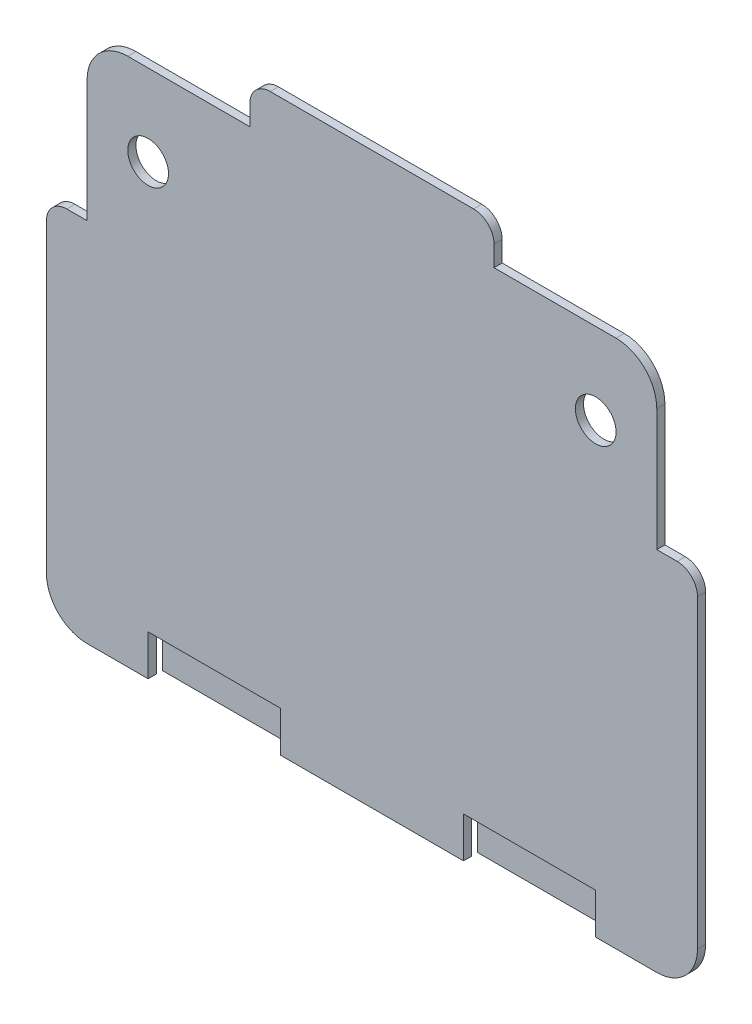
from build123d import *

# Parameters (mm, degrees)
BOSS_EXTRUDE1_DEPTH = 2
SKETCH2_W           = 32.5
SKETCH2_H           = 1.2
BOSS_EXTRUDE2_DEPTH = 1.5
SKETCH3_W           = 32.5
SKETCH3_H           = 10
SKETCH3_H_2         = 1.2
BOSS_EXTRUDE3_DEPTH = 1.2
SKETCH4_W           = 32.5
SKETCH4_H           = 10
SKETCH4_H_2         = 1.2
BOSS_EXTRUDE4_DEPTH = 1.2
SKETCH5_R           = 5
CUT_EXTRUDE1_DEPTH  = 143.21946665
FILLET3_R           = 10
FILLET4_R           = 10
FILLET5_R           = 5


with BuildPart() as part:
    # Sketch1 → Boss-Extrude1 (new body)
    with BuildSketch(Plane.XY):
        Polygon((97.407407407, -36.481481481), (97.407407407, 53.518518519), (87.407407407, 53.518518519), (87.407407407, 93.518518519), (47.407407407, 93.518518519), (47.407407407, 103.518518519), (-12.592592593, 103.518518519), (-12.592592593, 93.518518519), (-52.592592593, 93.518518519), (-52.592592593, 53.518518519), (-62.592592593, 53.518518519), (-62.592592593, -36.481481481), (-37.592592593, -36.481481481), (-37.592592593, -26.481481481), (-5.092592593, -26.481481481), (-5.092592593, -36.481481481), (39.907407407, -36.481481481), (39.907407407, -26.481481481), (72.407407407, -26.481481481), (72.407407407, -36.481481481), align=None)
    extrude(amount=BOSS_EXTRUDE1_DEPTH)

    # Sketch2 → Boss-Extrude2 (add)
    with BuildSketch(Plane(origin=(0, 0, 0), x_dir=(-1, 0, 0), z_dir=(0, 0, -1))):
        with Locations((-56.157407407, -25.881481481)):
            Rectangle(SKETCH2_W, SKETCH2_H)
        with Locations((21.342592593, -25.881481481)):
            Rectangle(SKETCH2_W, SKETCH2_H)
    extrude(amount=BOSS_EXTRUDE2_DEPTH)

    # Sketch3 → Boss-Extrude3 (add)
    with BuildSketch(Plane(origin=(0, 0, -1.5), x_dir=(-1, 0, 0), z_dir=(0, 0, -1))):
        with Locations((21.342592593, -31.481481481)):
            Rectangle(SKETCH3_W, SKETCH3_H)
        with Locations((21.342592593, -25.881481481)):
            Rectangle(SKETCH3_W, SKETCH3_H_2)
    extrude(amount=BOSS_EXTRUDE3_DEPTH)

    # Sketch4 → Boss-Extrude4 (add)
    with BuildSketch(Plane(origin=(0, 0, -1.5), x_dir=(-1, 0, 0), z_dir=(0, 0, -1))):
        with Locations((-56.157407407, -31.481481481)):
            Rectangle(SKETCH4_W, SKETCH4_H)
        with Locations((-56.157407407, -25.881481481)):
            Rectangle(SKETCH4_W, SKETCH4_H_2)
    extrude(amount=BOSS_EXTRUDE4_DEPTH)

    # Sketch5 → Cut-Extrude1 (cut, through all)
    with BuildSketch(Plane.XY.offset(2)):
        with Locations((72.407407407, 73.518518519)):
            Circle(SKETCH5_R)
        with Locations((-37.592592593, 73.518518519)):
            Circle(SKETCH5_R)
    extrude(amount=-CUT_EXTRUDE1_DEPTH, mode=Mode.SUBTRACT)

    # Fillet3
    fillet3_edges = [part.edges().sort_by_distance(p)[0] for p in [
        (-52.592592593, 93.518518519, 1),
    ]]
    fillet(fillet3_edges, radius=FILLET3_R)

    # Fillet4
    fillet4_edges = [part.edges().sort_by_distance(p)[0] for p in [
        (87.407407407, 93.518518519, 1),
        (97.407407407, -36.481481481, 1),
        (-62.592592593, -36.481481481, 1),
    ]]
    fillet(fillet4_edges, radius=FILLET4_R)

    # Fillet5
    fillet5_edges = [part.edges().sort_by_distance(p)[0] for p in [
        (-12.592592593, 103.518518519, 1),
        (47.407407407, 103.518518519, 1),
        (97.407407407, 53.518518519, 1),
        (-62.592592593, 53.518518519, 1),
    ]]
    fillet(fillet5_edges, radius=FILLET5_R)


solid = part.part
